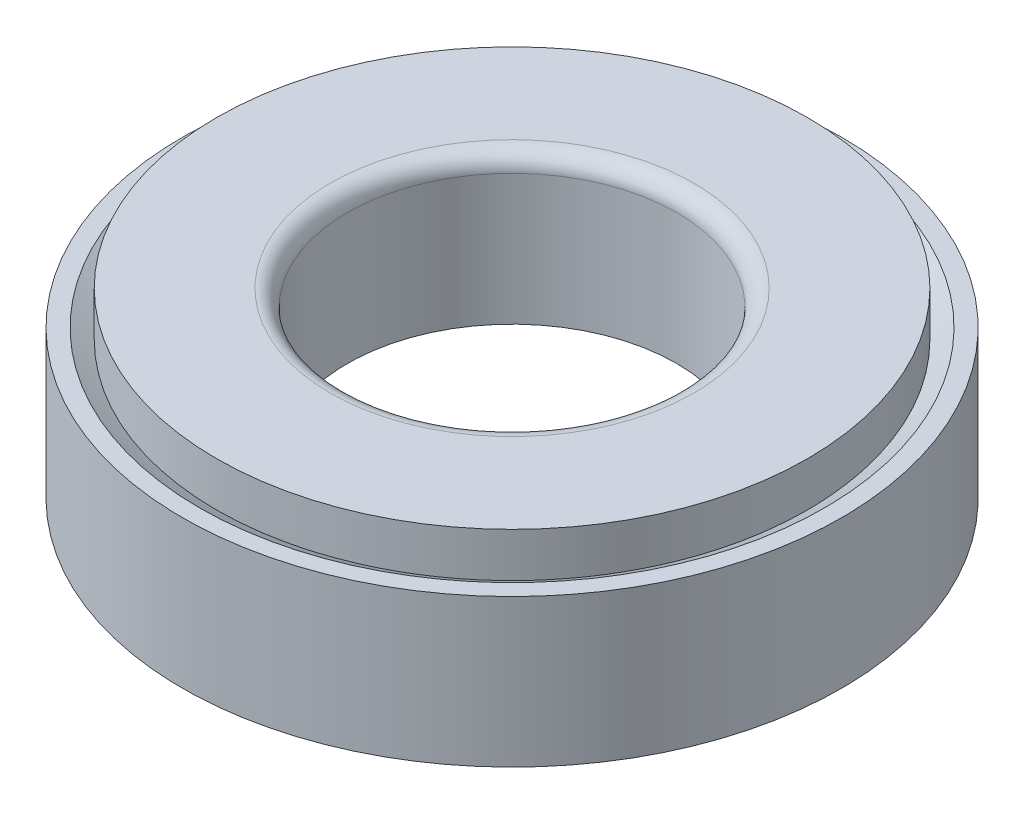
ISO-10303-21;
HEADER;
FILE_DESCRIPTION(('STEP AP214'),'2;1');
FILE_NAME('part.step','',(''),(''),'','','');
FILE_SCHEMA(('AUTOMOTIVE_DESIGN { 1 0 10303 214 1 1 1 1 }'));
ENDSEC;
DATA;
#1=APPLICATION_CONTEXT('core data for automotive mechanical design processes');
#2=APPLICATION_PROTOCOL_DEFINITION('international standard','automotive_design',2000,#1);
#3=PRODUCT_CONTEXT('',#1,'mechanical');
#4=PRODUCT('Part','Part','',(#3));
#5=PRODUCT_RELATED_PRODUCT_CATEGORY('part','',(#4));
#6=PRODUCT_DEFINITION_FORMATION('','',#4);
#7=PRODUCT_DEFINITION_CONTEXT('part definition',#1,'design');
#8=PRODUCT_DEFINITION('design','',#6,#7);
#9=PRODUCT_DEFINITION_SHAPE('','',#8);
#10=(LENGTH_UNIT() NAMED_UNIT(*) SI_UNIT(.MILLI.,.METRE.));
#11=(NAMED_UNIT(*) PLANE_ANGLE_UNIT() SI_UNIT($,.RADIAN.));
#12=(NAMED_UNIT(*) SI_UNIT($,.STERADIAN.) SOLID_ANGLE_UNIT());
#13=UNCERTAINTY_MEASURE_WITH_UNIT(LENGTH_MEASURE(1.E-05),#10,'distance_accuracy_value','');
#14=(GEOMETRIC_REPRESENTATION_CONTEXT(3) GLOBAL_UNCERTAINTY_ASSIGNED_CONTEXT((#13)) GLOBAL_UNIT_ASSIGNED_CONTEXT((#10,
#11,#12)) REPRESENTATION_CONTEXT('',''));
#15=CARTESIAN_POINT('',(0.,0.,0.));
#16=DIRECTION('',(0.,0.,1.));
#17=DIRECTION('',(1.,0.,0.));
#18=AXIS2_PLACEMENT_3D('',#15,#16,#17);
#19=CARTESIAN_POINT('',(0.,16.,0.));
#20=DIRECTION('',(0.,-1.,0.));
#21=DIRECTION('',(0.,0.,-1.));
#22=AXIS2_PLACEMENT_3D('',#19,#20,#21);
#23=CYLINDRICAL_SURFACE('',#22,26.);
#24=CARTESIAN_POINT('',(0.,12.079687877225,0.));
#25=DIRECTION('',(0.,1.,0.));
#26=DIRECTION('',(0.,0.,1.));
#27=AXIS2_PLACEMENT_3D('',#24,#25,#26);
#28=CIRCLE('',#27,26.);
#29=CARTESIAN_POINT('',(0.,12.079687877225,26.));
#30=VERTEX_POINT('',#29);
#31=EDGE_CURVE('P0_E29',#30,#30,#28,.T.);
#32=ORIENTED_EDGE('',*,*,#31,.T.);
#33=EDGE_LOOP('',(#32));
#34=FACE_BOUND('',#33,.T.);
#35=CARTESIAN_POINT('',(0.,16.,0.));
#36=DIRECTION('',(0.,1.,0.));
#37=DIRECTION('',(0.,0.,1.));
#38=AXIS2_PLACEMENT_3D('',#35,#36,#37);
#39=CIRCLE('',#38,26.);
#40=CARTESIAN_POINT('',(0.,16.,26.));
#41=VERTEX_POINT('',#40);
#42=EDGE_CURVE('P0_E25',#41,#41,#39,.T.);
#43=ORIENTED_EDGE('',*,*,#42,.F.);
#44=EDGE_LOOP('',(#43));
#45=FACE_BOUND('',#44,.T.);
#46=ADVANCED_FACE('P0_F14',(#34,#45),#23,.T.);
#47=CARTESIAN_POINT('',(0.,16.,0.));
#48=DIRECTION('',(0.,1.,0.));
#49=DIRECTION('',(0.,0.,1.));
#50=AXIS2_PLACEMENT_3D('',#47,#48,#49);
#51=PLANE('',#50);
#52=CARTESIAN_POINT('',(0.,16.,0.));
#53=DIRECTION('',(0.,1.,0.));
#54=DIRECTION('',(0.,0.,1.));
#55=AXIS2_PLACEMENT_3D('',#52,#53,#54);
#56=CIRCLE('',#55,16.);
#57=CARTESIAN_POINT('',(0.,16.,16.));
#58=VERTEX_POINT('',#57);
#59=EDGE_CURVE('P0_E21',#58,#58,#56,.F.);
#60=ORIENTED_EDGE('',*,*,#59,.T.);
#61=EDGE_LOOP('',(#60));
#62=FACE_BOUND('',#61,.T.);
#63=ORIENTED_EDGE('',*,*,#42,.T.);
#64=EDGE_LOOP('',(#63));
#65=FACE_BOUND('',#64,.T.);
#66=ADVANCED_FACE('P0_F92',(#62,#65),#51,.T.);
#67=CARTESIAN_POINT('',(0.,56.1391826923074,0.));
#68=DIRECTION('',(-1.,0.,0.));
#69=DIRECTION('',(0.,-1.,0.));
#70=AXIS2_PLACEMENT_3D('',#67,#68,#69);
#71=SPHERICAL_SURFACE('',#70,51.1589589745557);
#72=CARTESIAN_POINT('',(0.,56.1391826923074,0.));
#73=DIRECTION('',(0.,1.,0.));
#74=DIRECTION('',(0.,0.,1.));
#75=AXIS2_PLACEMENT_3D('',#72,#73,#74);
#76=SPHERICAL_SURFACE('',#75,51.1589589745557);
#77=CARTESIAN_POINT('',(0.,7.80000000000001,0.));
#78=DIRECTION('',(0.,1.,0.));
#79=DIRECTION('',(0.,0.,1.));
#80=AXIS2_PLACEMENT_3D('',#77,#78,#79);
#81=CIRCLE('',#80,16.75);
#82=CARTESIAN_POINT('',(0.,7.80000000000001,16.75));
#83=VERTEX_POINT('',#82);
#84=EDGE_CURVE('P0_E49',#83,#83,#81,.T.);
#85=ORIENTED_EDGE('',*,*,#84,.T.);
#86=EDGE_LOOP('',(#85));
#87=FACE_BOUND('',#86,.T.);
#88=ORIENTED_EDGE('',*,*,#31,.F.);
#89=EDGE_LOOP('',(#88));
#90=FACE_BOUND('',#89,.T.);
#91=ADVANCED_FACE('P0_F53',(#87,#90),#76,.T.);
#92=CARTESIAN_POINT('',(0.,3.,0.));
#93=DIRECTION('',(0.,1.,0.));
#94=DIRECTION('',(0.,0.,1.));
#95=AXIS2_PLACEMENT_3D('',#92,#93,#94);
#96=CYLINDRICAL_SURFACE('',#95,16.75);
#97=CARTESIAN_POINT('',(0.,5.4,0.));
#98=DIRECTION('',(0.,1.,0.));
#99=DIRECTION('',(0.,0.,1.));
#100=AXIS2_PLACEMENT_3D('',#97,#98,#99);
#101=CIRCLE('',#100,16.75);
#102=CARTESIAN_POINT('',(0.,5.4,16.75));
#103=VERTEX_POINT('',#102);
#104=EDGE_CURVE('P0_E40',#103,#103,#101,.T.);
#105=CARTESIAN_POINT('',(0.,3.,0.));
#106=DIRECTION('',(0.,1.,0.));
#107=DIRECTION('',(0.,0.,1.));
#108=AXIS2_PLACEMENT_3D('',#105,#106,#107);
#109=CIRCLE('',#108,16.75);
#110=CARTESIAN_POINT('',(0.,3.,16.75));
#111=VERTEX_POINT('',#110);
#112=EDGE_CURVE('P0_E33',#111,#111,#109,.T.);
#113=CARTESIAN_POINT('',(0.,5.4,16.75));
#114=CARTESIAN_POINT('',(0.,5.375,16.75));
#115=CARTESIAN_POINT('',(0.,5.34999999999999,16.75));
#116=CARTESIAN_POINT('',(0.,5.29999999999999,16.75));
#117=CARTESIAN_POINT('',(0.,5.275,16.75));
#118=CARTESIAN_POINT('',(0.,5.225,16.75));
#119=CARTESIAN_POINT('',(0.,5.2,16.75));
#120=CARTESIAN_POINT('',(0.,5.15,16.75));
#121=CARTESIAN_POINT('',(0.,5.12499999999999,16.75));
#122=CARTESIAN_POINT('',(0.,5.075,16.75));
#123=CARTESIAN_POINT('',(0.,5.05,16.75));
#124=CARTESIAN_POINT('',(0.,5.,16.75));
#125=CARTESIAN_POINT('',(0.,4.975,16.75));
#126=CARTESIAN_POINT('',(0.,4.925,16.75));
#127=CARTESIAN_POINT('',(0.,4.9,16.75));
#128=CARTESIAN_POINT('',(0.,4.85,16.75));
#129=CARTESIAN_POINT('',(0.,4.825,16.75));
#130=CARTESIAN_POINT('',(0.,4.775,16.75));
#131=CARTESIAN_POINT('',(0.,4.75,16.75));
#132=CARTESIAN_POINT('',(0.,4.7,16.75));
#133=CARTESIAN_POINT('',(0.,4.675,16.75));
#134=CARTESIAN_POINT('',(0.,4.625,16.75));
#135=CARTESIAN_POINT('',(0.,4.6,16.75));
#136=CARTESIAN_POINT('',(0.,4.55,16.75));
#137=CARTESIAN_POINT('',(0.,4.525,16.75));
#138=CARTESIAN_POINT('',(0.,4.475,16.75));
#139=CARTESIAN_POINT('',(0.,4.45,16.75));
#140=CARTESIAN_POINT('',(0.,4.4,16.75));
#141=CARTESIAN_POINT('',(0.,4.375,16.75));
#142=CARTESIAN_POINT('',(0.,4.325,16.75));
#143=CARTESIAN_POINT('',(0.,4.3,16.75));
#144=CARTESIAN_POINT('',(0.,4.25,16.75));
#145=CARTESIAN_POINT('',(0.,4.225,16.75));
#146=CARTESIAN_POINT('',(0.,4.175,16.75));
#147=CARTESIAN_POINT('',(0.,4.15,16.75));
#148=CARTESIAN_POINT('',(0.,4.1,16.75));
#149=CARTESIAN_POINT('',(0.,4.075,16.75));
#150=CARTESIAN_POINT('',(0.,4.025,16.75));
#151=CARTESIAN_POINT('',(0.,4.,16.75));
#152=CARTESIAN_POINT('',(0.,3.95,16.75));
#153=CARTESIAN_POINT('',(0.,3.925,16.75));
#154=CARTESIAN_POINT('',(0.,3.875,16.75));
#155=CARTESIAN_POINT('',(0.,3.85,16.75));
#156=CARTESIAN_POINT('',(0.,3.8,16.75));
#157=CARTESIAN_POINT('',(0.,3.775,16.75));
#158=CARTESIAN_POINT('',(0.,3.725,16.75));
#159=CARTESIAN_POINT('',(0.,3.7,16.75));
#160=CARTESIAN_POINT('',(0.,3.65,16.75));
#161=CARTESIAN_POINT('',(0.,3.625,16.75));
#162=CARTESIAN_POINT('',(0.,3.575,16.75));
#163=CARTESIAN_POINT('',(0.,3.55,16.75));
#164=CARTESIAN_POINT('',(0.,3.5,16.75));
#165=CARTESIAN_POINT('',(0.,3.475,16.75));
#166=CARTESIAN_POINT('',(0.,3.425,16.75));
#167=CARTESIAN_POINT('',(0.,3.4,16.75));
#168=CARTESIAN_POINT('',(0.,3.35,16.75));
#169=CARTESIAN_POINT('',(0.,3.325,16.75));
#170=CARTESIAN_POINT('',(0.,3.275,16.75));
#171=CARTESIAN_POINT('',(0.,3.25,16.75));
#172=CARTESIAN_POINT('',(0.,3.2,16.75));
#173=CARTESIAN_POINT('',(0.,3.175,16.75));
#174=CARTESIAN_POINT('',(0.,3.125,16.75));
#175=CARTESIAN_POINT('',(0.,3.1,16.75));
#176=CARTESIAN_POINT('',(0.,3.05,16.75));
#177=CARTESIAN_POINT('',(0.,3.025,16.75));
#178=CARTESIAN_POINT('',(0.,3.,16.75));
#179=B_SPLINE_CURVE_WITH_KNOTS('',3,(#113,#114,#115,#116,#117,#118,#119,#120,#121,#122,#123,
#124,#125,#126,#127,#128,#129,#130,#131,#132,#133,#134,#135,#136,#137,#138,#139,#140,#141,#142,
#143,#144,#145,#146,#147,#148,#149,#150,#151,#152,#153,#154,#155,#156,#157,#158,#159,#160,#161,
#162,#163,#164,#165,#166,#167,#168,#169,#170,#171,#172,#173,#174,#175,#176,#177,#178),
.UNSPECIFIED.,.F.,.F.,(4,2,2,2,2,2,2,2,2,2,2,2,2,2,2,2,2,2,2,2,2,2,2,2,2,2,2,2,2,2,2,2,4),(0.,
0.0750000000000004,0.15,0.225,0.3,0.374999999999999,0.449999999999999,0.524999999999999,
0.599999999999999,0.674999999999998,0.749999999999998,0.824999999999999,0.899999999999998,
0.974999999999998,1.05,1.125,1.2,1.275,1.35,1.425,1.5,1.575,1.65,1.725,1.8,1.875,1.95,2.025,2.1,
2.17499999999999,2.24999999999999,2.32499999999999,2.39999999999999),.UNSPECIFIED.);
#180=EDGE_CURVE('P0_BSEAM75',#103,#111,#179,.T.);
#181=ORIENTED_EDGE('',*,*,#104,.F.);
#182=ORIENTED_EDGE('',*,*,#112,.T.);
#183=ORIENTED_EDGE('',*,*,#180,.T.);
#184=ORIENTED_EDGE('',*,*,#180,.F.);
#185=EDGE_LOOP('',(#181,#183,#182,#184));
#186=FACE_BOUND('',#185,.T.);
#187=ADVANCED_FACE('P0_F75',(#186),#96,.T.);
#188=CARTESIAN_POINT('',(0.,3.,0.));
#189=DIRECTION('',(0.,1.,0.));
#190=DIRECTION('',(0.,0.,1.));
#191=AXIS2_PLACEMENT_3D('',#188,#189,#190);
#192=PLANE('',#191);
#193=CARTESIAN_POINT('',(0.,3.,0.));
#194=DIRECTION('',(0.,-1.,0.));
#195=DIRECTION('',(0.,0.,-1.));
#196=AXIS2_PLACEMENT_3D('',#193,#194,#195);
#197=CIRCLE('',#196,14.5);
#198=CARTESIAN_POINT('',(0.,3.,-14.5));
#199=VERTEX_POINT('',#198);
#200=EDGE_CURVE('P0_E37',#199,#199,#197,.T.);
#201=ORIENTED_EDGE('',*,*,#200,.F.);
#202=EDGE_LOOP('',(#201));
#203=FACE_BOUND('',#202,.T.);
#204=ORIENTED_EDGE('',*,*,#112,.F.);
#205=EDGE_LOOP('',(#204));
#206=FACE_BOUND('',#205,.T.);
#207=ADVANCED_FACE('P0_F78',(#203,#206),#192,.F.);
#208=CARTESIAN_POINT('',(0.,16.,0.));
#209=DIRECTION('',(0.,-1.,0.));
#210=DIRECTION('',(0.,0.,-1.));
#211=AXIS2_PLACEMENT_3D('',#208,#209,#210);
#212=CYLINDRICAL_SURFACE('',#211,14.5);
#213=CARTESIAN_POINT('',(0.,14.5,0.));
#214=DIRECTION('',(0.,1.,0.));
#215=DIRECTION('',(0.,0.,1.));
#216=AXIS2_PLACEMENT_3D('',#213,#214,#215);
#217=CIRCLE('',#216,14.5);
#218=CARTESIAN_POINT('',(0.,14.5,-14.5));
#219=VERTEX_POINT('',#218);
#220=EDGE_CURVE('P0_E10',#219,#219,#217,.T.);
#221=CARTESIAN_POINT('',(0.,14.5,-14.5));
#222=CARTESIAN_POINT('',(0.,14.3802083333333,-14.5));
#223=CARTESIAN_POINT('',(0.,14.2604166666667,-14.5));
#224=CARTESIAN_POINT('',(0.,14.0208333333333,-14.5));
#225=CARTESIAN_POINT('',(0.,13.9010416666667,-14.5));
#226=CARTESIAN_POINT('',(0.,13.6614583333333,-14.5));
#227=CARTESIAN_POINT('',(0.,13.5416666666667,-14.5));
#228=CARTESIAN_POINT('',(0.,13.3020833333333,-14.5));
#229=CARTESIAN_POINT('',(0.,13.1822916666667,-14.5));
#230=CARTESIAN_POINT('',(0.,12.9427083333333,-14.5));
#231=CARTESIAN_POINT('',(0.,12.8229166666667,-14.5));
#232=CARTESIAN_POINT('',(0.,12.5833333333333,-14.5));
#233=CARTESIAN_POINT('',(0.,12.4635416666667,-14.5));
#234=CARTESIAN_POINT('',(0.,12.2239583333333,-14.5));
#235=CARTESIAN_POINT('',(0.,12.1041666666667,-14.5));
#236=CARTESIAN_POINT('',(0.,11.8645833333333,-14.5));
#237=CARTESIAN_POINT('',(0.,11.7447916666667,-14.5));
#238=CARTESIAN_POINT('',(0.,11.5052083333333,-14.5));
#239=CARTESIAN_POINT('',(0.,11.3854166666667,-14.5));
#240=CARTESIAN_POINT('',(0.,11.1458333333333,-14.5));
#241=CARTESIAN_POINT('',(0.,11.0260416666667,-14.5));
#242=CARTESIAN_POINT('',(0.,10.7864583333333,-14.5));
#243=CARTESIAN_POINT('',(0.,10.6666666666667,-14.5));
#244=CARTESIAN_POINT('',(0.,10.4270833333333,-14.5));
#245=CARTESIAN_POINT('',(0.,10.3072916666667,-14.5));
#246=CARTESIAN_POINT('',(0.,10.0677083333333,-14.5));
#247=CARTESIAN_POINT('',(0.,9.94791666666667,-14.5));
#248=CARTESIAN_POINT('',(0.,9.70833333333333,-14.5));
#249=CARTESIAN_POINT('',(0.,9.58854166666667,-14.5));
#250=CARTESIAN_POINT('',(0.,9.34895833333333,-14.5));
#251=CARTESIAN_POINT('',(0.,9.22916666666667,-14.5));
#252=CARTESIAN_POINT('',(0.,8.98958333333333,-14.5));
#253=CARTESIAN_POINT('',(0.,8.86979166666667,-14.5));
#254=CARTESIAN_POINT('',(0.,8.63020833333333,-14.5));
#255=CARTESIAN_POINT('',(0.,8.51041666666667,-14.5));
#256=CARTESIAN_POINT('',(0.,8.27083333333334,-14.5));
#257=CARTESIAN_POINT('',(0.,8.15104166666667,-14.5));
#258=CARTESIAN_POINT('',(0.,7.91145833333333,-14.5));
#259=CARTESIAN_POINT('',(0.,7.79166666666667,-14.5));
#260=CARTESIAN_POINT('',(0.,7.55208333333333,-14.5));
#261=CARTESIAN_POINT('',(0.,7.43229166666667,-14.5));
#262=CARTESIAN_POINT('',(0.,7.19270833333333,-14.5));
#263=CARTESIAN_POINT('',(0.,7.07291666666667,-14.5));
#264=CARTESIAN_POINT('',(0.,6.83333333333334,-14.5));
#265=CARTESIAN_POINT('',(0.,6.71354166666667,-14.5));
#266=CARTESIAN_POINT('',(0.,6.47395833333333,-14.5));
#267=CARTESIAN_POINT('',(0.,6.35416666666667,-14.5));
#268=CARTESIAN_POINT('',(0.,6.11458333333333,-14.5));
#269=CARTESIAN_POINT('',(0.,5.99479166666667,-14.5));
#270=CARTESIAN_POINT('',(0.,5.75520833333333,-14.5));
#271=CARTESIAN_POINT('',(0.,5.63541666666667,-14.5));
#272=CARTESIAN_POINT('',(0.,5.39583333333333,-14.5));
#273=CARTESIAN_POINT('',(0.,5.27604166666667,-14.5));
#274=CARTESIAN_POINT('',(0.,5.03645833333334,-14.5));
#275=CARTESIAN_POINT('',(0.,4.91666666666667,-14.5));
#276=CARTESIAN_POINT('',(0.,4.67708333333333,-14.5));
#277=CARTESIAN_POINT('',(0.,4.55729166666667,-14.5));
#278=CARTESIAN_POINT('',(0.,4.31770833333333,-14.5));
#279=CARTESIAN_POINT('',(0.,4.19791666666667,-14.5));
#280=CARTESIAN_POINT('',(0.,3.95833333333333,-14.5));
#281=CARTESIAN_POINT('',(0.,3.83854166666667,-14.5));
#282=CARTESIAN_POINT('',(0.,3.59895833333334,-14.5));
#283=CARTESIAN_POINT('',(0.,3.47916666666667,-14.5));
#284=CARTESIAN_POINT('',(0.,3.23958333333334,-14.5));
#285=CARTESIAN_POINT('',(0.,3.11979166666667,-14.5));
#286=CARTESIAN_POINT('',(0.,3.,-14.5));
#287=B_SPLINE_CURVE_WITH_KNOTS('',3,(#221,#222,#223,#224,#225,#226,#227,#228,#229,#230,#231,
#232,#233,#234,#235,#236,#237,#238,#239,#240,#241,#242,#243,#244,#245,#246,#247,#248,#249,#250,
#251,#252,#253,#254,#255,#256,#257,#258,#259,#260,#261,#262,#263,#264,#265,#266,#267,#268,#269,
#270,#271,#272,#273,#274,#275,#276,#277,#278,#279,#280,#281,#282,#283,#284,#285,#286),
.UNSPECIFIED.,.F.,.F.,(4,2,2,2,2,2,2,2,2,2,2,2,2,2,2,2,2,2,2,2,2,2,2,2,2,2,2,2,2,2,2,2,4),(0.,
0.359375,0.718750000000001,1.078125,1.4375,1.796875,2.15625,2.515625,2.875,3.234375,3.59375,
3.953125,4.3125,4.671875,5.03125,5.390625,5.75,6.109375,6.46875,6.828125,7.1875,7.546875,
7.90625,8.265625,8.625,8.984375,9.34375,9.703125,10.0625,10.421875,10.78125,11.140625,11.5),.UNSPECIFIED.);
#288=EDGE_CURVE('P0_BSEAM71',#219,#199,#287,.T.);
#289=ORIENTED_EDGE('',*,*,#220,.T.);
#290=ORIENTED_EDGE('',*,*,#200,.T.);
#291=ORIENTED_EDGE('',*,*,#288,.T.);
#292=ORIENTED_EDGE('',*,*,#288,.F.);
#293=EDGE_LOOP('',(#289,#291,#290,#292));
#294=FACE_BOUND('',#293,.T.);
#295=ADVANCED_FACE('P0_F71',(#294),#212,.F.);
#296=CARTESIAN_POINT('',(-16.75,5.4,0.));
#297=DIRECTION('',(0.,-1.,0.));
#298=DIRECTION('',(0.,0.,-1.));
#299=AXIS2_PLACEMENT_3D('',#296,#297,#298);
#300=PLANE('',#299);
#301=CARTESIAN_POINT('',(0.,5.4,0.));
#302=DIRECTION('',(0.,1.,0.));
#303=DIRECTION('',(0.,0.,1.));
#304=AXIS2_PLACEMENT_3D('',#301,#302,#303);
#305=CIRCLE('',#304,15.625);
#306=CARTESIAN_POINT('',(0.,5.4,15.625));
#307=VERTEX_POINT('',#306);
#308=EDGE_CURVE('P0_E43',#307,#307,#305,.T.);
#309=ORIENTED_EDGE('',*,*,#308,.F.);
#310=EDGE_LOOP('',(#309));
#311=FACE_BOUND('',#310,.T.);
#312=ORIENTED_EDGE('',*,*,#104,.T.);
#313=EDGE_LOOP('',(#312));
#314=FACE_BOUND('',#313,.T.);
#315=ADVANCED_FACE('P0_F65',(#311,#314),#300,.F.);
#316=CARTESIAN_POINT('',(0.,16.,0.));
#317=DIRECTION('',(0.,1.,0.));
#318=DIRECTION('',(0.,0.,1.));
#319=AXIS2_PLACEMENT_3D('',#316,#317,#318);
#320=CYLINDRICAL_SURFACE('',#319,15.625);
#321=CARTESIAN_POINT('',(0.,7.80000000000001,0.));
#322=DIRECTION('',(0.,1.,0.));
#323=DIRECTION('',(0.,0.,1.));
#324=AXIS2_PLACEMENT_3D('',#321,#322,#323);
#325=CIRCLE('',#324,15.625);
#326=CARTESIAN_POINT('',(0.,7.80000000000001,15.625));
#327=VERTEX_POINT('',#326);
#328=EDGE_CURVE('P0_E46',#327,#327,#325,.T.);
#329=ORIENTED_EDGE('',*,*,#328,.F.);
#330=EDGE_LOOP('',(#329));
#331=FACE_BOUND('',#330,.T.);
#332=ORIENTED_EDGE('',*,*,#308,.T.);
#333=EDGE_LOOP('',(#332));
#334=FACE_BOUND('',#333,.T.);
#335=ADVANCED_FACE('P0_F59',(#331,#334),#320,.T.);
#336=CARTESIAN_POINT('',(-16.75,7.80000000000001,0.));
#337=DIRECTION('',(0.,1.,0.));
#338=DIRECTION('',(0.,0.,1.));
#339=AXIS2_PLACEMENT_3D('',#336,#337,#338);
#340=PLANE('',#339);
#341=ORIENTED_EDGE('',*,*,#84,.F.);
#342=EDGE_LOOP('',(#341));
#343=FACE_BOUND('',#342,.T.);
#344=ORIENTED_EDGE('',*,*,#328,.T.);
#345=EDGE_LOOP('',(#344));
#346=FACE_BOUND('',#345,.T.);
#347=ADVANCED_FACE('P0_F56',(#343,#346),#340,.F.);
#348=CARTESIAN_POINT('',(0.,14.5,0.));
#349=DIRECTION('',(0.,1.,0.));
#350=DIRECTION('',(0.,0.,1.));
#351=AXIS2_PLACEMENT_3D('',#348,#349,#350);
#352=TOROIDAL_SURFACE('',#351,16.,1.5);
#353=ORIENTED_EDGE('',*,*,#220,.F.);
#354=EDGE_LOOP('',(#353));
#355=FACE_BOUND('',#354,.T.);
#356=ORIENTED_EDGE('',*,*,#59,.F.);
#357=EDGE_LOOP('',(#356));
#358=FACE_BOUND('',#357,.T.);
#359=ADVANCED_FACE('P0_F16',(#355,#358),#352,.T.);
#360=CLOSED_SHELL('',(#46,#66,#91,#187,#207,#295,#315,#335,#347,#359));
#361=MANIFOLD_SOLID_BREP('P0_B1',#360);
#362=CARTESIAN_POINT('',(0.,13.,0.));
#363=DIRECTION('',(0.,-1.,0.));
#364=DIRECTION('',(0.,0.,-1.));
#365=AXIS2_PLACEMENT_3D('',#362,#363,#364);
#366=CYLINDRICAL_SURFACE('',#365,29.);
#367=CARTESIAN_POINT('',(0.,13.,0.));
#368=DIRECTION('',(0.,1.,0.));
#369=DIRECTION('',(0.,0.,1.));
#370=AXIS2_PLACEMENT_3D('',#367,#368,#369);
#371=CIRCLE('',#370,29.);
#372=CARTESIAN_POINT('',(0.,13.,-29.));
#373=VERTEX_POINT('',#372);
#374=EDGE_CURVE('P1_E9',#373,#373,#371,.T.);
#375=CARTESIAN_POINT('',(0.,0.,0.));
#376=DIRECTION('',(0.,1.,0.));
#377=DIRECTION('',(0.,0.,1.));
#378=AXIS2_PLACEMENT_3D('',#375,#376,#377);
#379=CIRCLE('',#378,29.);
#380=CARTESIAN_POINT('',(0.,0.,-29.));
#381=VERTEX_POINT('',#380);
#382=EDGE_CURVE('P1_E20',#381,#381,#379,.T.);
#383=CARTESIAN_POINT('',(0.,13.,-29.));
#384=CARTESIAN_POINT('',(0.,12.8645833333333,-29.));
#385=CARTESIAN_POINT('',(0.,12.7291666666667,-29.));
#386=CARTESIAN_POINT('',(0.,12.4583333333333,-29.));
#387=CARTESIAN_POINT('',(0.,12.3229166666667,-29.));
#388=CARTESIAN_POINT('',(0.,12.0520833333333,-29.));
#389=CARTESIAN_POINT('',(0.,11.9166666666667,-29.));
#390=CARTESIAN_POINT('',(0.,11.6458333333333,-29.));
#391=CARTESIAN_POINT('',(0.,11.5104166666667,-29.));
#392=CARTESIAN_POINT('',(0.,11.2395833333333,-29.));
#393=CARTESIAN_POINT('',(0.,11.1041666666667,-29.));
#394=CARTESIAN_POINT('',(0.,10.8333333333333,-29.));
#395=CARTESIAN_POINT('',(0.,10.6979166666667,-29.));
#396=CARTESIAN_POINT('',(0.,10.4270833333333,-29.));
#397=CARTESIAN_POINT('',(0.,10.2916666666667,-29.));
#398=CARTESIAN_POINT('',(0.,10.0208333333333,-29.));
#399=CARTESIAN_POINT('',(0.,9.88541666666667,-29.));
#400=CARTESIAN_POINT('',(0.,9.61458333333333,-29.));
#401=CARTESIAN_POINT('',(0.,9.47916666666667,-29.));
#402=CARTESIAN_POINT('',(0.,9.20833333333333,-29.));
#403=CARTESIAN_POINT('',(0.,9.07291666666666,-29.));
#404=CARTESIAN_POINT('',(0.,8.80208333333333,-29.));
#405=CARTESIAN_POINT('',(0.,8.66666666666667,-29.));
#406=CARTESIAN_POINT('',(0.,8.39583333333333,-29.));
#407=CARTESIAN_POINT('',(0.,8.26041666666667,-29.));
#408=CARTESIAN_POINT('',(0.,7.98958333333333,-29.));
#409=CARTESIAN_POINT('',(0.,7.85416666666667,-29.));
#410=CARTESIAN_POINT('',(0.,7.58333333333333,-29.));
#411=CARTESIAN_POINT('',(0.,7.44791666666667,-29.));
#412=CARTESIAN_POINT('',(0.,7.17708333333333,-29.));
#413=CARTESIAN_POINT('',(0.,7.04166666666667,-29.));
#414=CARTESIAN_POINT('',(0.,6.77083333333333,-29.));
#415=CARTESIAN_POINT('',(0.,6.63541666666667,-29.));
#416=CARTESIAN_POINT('',(0.,6.36458333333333,-29.));
#417=CARTESIAN_POINT('',(0.,6.22916666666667,-29.));
#418=CARTESIAN_POINT('',(0.,5.95833333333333,-29.));
#419=CARTESIAN_POINT('',(0.,5.82291666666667,-29.));
#420=CARTESIAN_POINT('',(0.,5.55208333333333,-29.));
#421=CARTESIAN_POINT('',(0.,5.41666666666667,-29.));
#422=CARTESIAN_POINT('',(0.,5.14583333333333,-29.));
#423=CARTESIAN_POINT('',(0.,5.01041666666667,-29.));
#424=CARTESIAN_POINT('',(0.,4.73958333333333,-29.));
#425=CARTESIAN_POINT('',(0.,4.60416666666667,-29.));
#426=CARTESIAN_POINT('',(0.,4.33333333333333,-29.));
#427=CARTESIAN_POINT('',(0.,4.19791666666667,-29.));
#428=CARTESIAN_POINT('',(0.,3.92708333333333,-29.));
#429=CARTESIAN_POINT('',(0.,3.79166666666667,-29.));
#430=CARTESIAN_POINT('',(0.,3.52083333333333,-29.));
#431=CARTESIAN_POINT('',(0.,3.38541666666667,-29.));
#432=CARTESIAN_POINT('',(0.,3.11458333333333,-29.));
#433=CARTESIAN_POINT('',(0.,2.97916666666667,-29.));
#434=CARTESIAN_POINT('',(0.,2.70833333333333,-29.));
#435=CARTESIAN_POINT('',(0.,2.57291666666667,-29.));
#436=CARTESIAN_POINT('',(0.,2.30208333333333,-29.));
#437=CARTESIAN_POINT('',(0.,2.16666666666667,-29.));
#438=CARTESIAN_POINT('',(0.,1.89583333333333,-29.));
#439=CARTESIAN_POINT('',(0.,1.76041666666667,-29.));
#440=CARTESIAN_POINT('',(0.,1.48958333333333,-29.));
#441=CARTESIAN_POINT('',(0.,1.35416666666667,-29.));
#442=CARTESIAN_POINT('',(0.,1.08333333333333,-29.));
#443=CARTESIAN_POINT('',(0.,0.947916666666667,-29.));
#444=CARTESIAN_POINT('',(0.,0.677083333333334,-29.));
#445=CARTESIAN_POINT('',(0.,0.541666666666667,-29.));
#446=CARTESIAN_POINT('',(0.,0.270833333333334,-29.));
#447=CARTESIAN_POINT('',(0.,0.135416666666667,-29.));
#448=CARTESIAN_POINT('',(0.,0.,-29.));
#449=B_SPLINE_CURVE_WITH_KNOTS('',3,(#383,#384,#385,#386,#387,#388,#389,#390,#391,#392,#393,
#394,#395,#396,#397,#398,#399,#400,#401,#402,#403,#404,#405,#406,#407,#408,#409,#410,#411,#412,
#413,#414,#415,#416,#417,#418,#419,#420,#421,#422,#423,#424,#425,#426,#427,#428,#429,#430,#431,
#432,#433,#434,#435,#436,#437,#438,#439,#440,#441,#442,#443,#444,#445,#446,#447,#448),
.UNSPECIFIED.,.F.,.F.,(4,2,2,2,2,2,2,2,2,2,2,2,2,2,2,2,2,2,2,2,2,2,2,2,2,2,2,2,2,2,2,2,4),(0.,
0.40625,0.812500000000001,1.21875,1.625,2.03125,2.4375,2.84375,3.25,3.65625,4.0625,4.46875,
4.875,5.28125,5.6875,6.09375,6.5,6.90625,7.3125,7.71875,8.125,8.53125,8.9375,9.34375,9.75,
10.15625,10.5625,10.96875,11.375,11.78125,12.1875,12.59375,13.),.UNSPECIFIED.);
#450=EDGE_CURVE('P1_BSEAM13',#373,#381,#449,.T.);
#451=ORIENTED_EDGE('',*,*,#374,.F.);
#452=ORIENTED_EDGE('',*,*,#382,.T.);
#453=ORIENTED_EDGE('',*,*,#450,.T.);
#454=ORIENTED_EDGE('',*,*,#450,.F.);
#455=EDGE_LOOP('',(#451,#453,#452,#454));
#456=FACE_BOUND('',#455,.T.);
#457=ADVANCED_FACE('P1_F13',(#456),#366,.T.);
#458=CARTESIAN_POINT('',(0.,13.,0.));
#459=DIRECTION('',(0.,1.,0.));
#460=DIRECTION('',(0.,0.,1.));
#461=AXIS2_PLACEMENT_3D('',#458,#459,#460);
#462=PLANE('',#461);
#463=CARTESIAN_POINT('',(0.,13.,0.));
#464=DIRECTION('',(0.,1.,0.));
#465=DIRECTION('',(0.,0.,1.));
#466=AXIS2_PLACEMENT_3D('',#463,#464,#465);
#467=CIRCLE('',#466,27.5);
#468=CARTESIAN_POINT('',(0.,13.,27.5));
#469=VERTEX_POINT('',#468);
#470=EDGE_CURVE('P1_E35',#469,#469,#467,.T.);
#471=ORIENTED_EDGE('',*,*,#470,.F.);
#472=EDGE_LOOP('',(#471));
#473=FACE_BOUND('',#472,.T.);
#474=ORIENTED_EDGE('',*,*,#374,.T.);
#475=EDGE_LOOP('',(#474));
#476=FACE_BOUND('',#475,.T.);
#477=ADVANCED_FACE('P1_F55',(#473,#476),#462,.T.);
#478=CARTESIAN_POINT('',(0.,0.,0.));
#479=DIRECTION('',(0.,1.,0.));
#480=DIRECTION('',(0.,0.,1.));
#481=AXIS2_PLACEMENT_3D('',#478,#479,#480);
#482=PLANE('',#481);
#483=CARTESIAN_POINT('',(0.,0.,0.));
#484=DIRECTION('',(0.,-1.,0.));
#485=DIRECTION('',(0.,0.,-1.));
#486=AXIS2_PLACEMENT_3D('',#483,#484,#485);
#487=CIRCLE('',#486,19.);
#488=CARTESIAN_POINT('',(0.,0.,-19.));
#489=VERTEX_POINT('',#488);
#490=EDGE_CURVE('P1_E27',#489,#489,#487,.T.);
#491=ORIENTED_EDGE('',*,*,#490,.F.);
#492=EDGE_LOOP('',(#491));
#493=FACE_BOUND('',#492,.T.);
#494=ORIENTED_EDGE('',*,*,#382,.F.);
#495=EDGE_LOOP('',(#494));
#496=FACE_BOUND('',#495,.T.);
#497=ADVANCED_FACE('P1_F60',(#493,#496),#482,.F.);
#498=CARTESIAN_POINT('',(0.,6.5,0.));
#499=DIRECTION('',(0.,-1.,0.));
#500=DIRECTION('',(0.,0.,-1.));
#501=AXIS2_PLACEMENT_3D('',#498,#499,#500);
#502=CYLINDRICAL_SURFACE('',#501,19.);
#503=CARTESIAN_POINT('',(0.,6.5,0.));
#504=DIRECTION('',(0.,-1.,0.));
#505=DIRECTION('',(0.,0.,-1.));
#506=AXIS2_PLACEMENT_3D('',#503,#504,#505);
#507=CIRCLE('',#506,19.);
#508=CARTESIAN_POINT('',(0.,6.5,-19.));
#509=VERTEX_POINT('',#508);
#510=EDGE_CURVE('P1_E25',#509,#509,#507,.T.);
#511=CARTESIAN_POINT('',(0.,6.5,-19.));
#512=CARTESIAN_POINT('',(0.,6.43229166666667,-19.));
#513=CARTESIAN_POINT('',(0.,6.36458333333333,-19.));
#514=CARTESIAN_POINT('',(0.,6.22916666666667,-19.));
#515=CARTESIAN_POINT('',(0.,6.16145833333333,-19.));
#516=CARTESIAN_POINT('',(0.,6.02604166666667,-19.));
#517=CARTESIAN_POINT('',(0.,5.95833333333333,-19.));
#518=CARTESIAN_POINT('',(0.,5.82291666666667,-19.));
#519=CARTESIAN_POINT('',(0.,5.75520833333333,-19.));
#520=CARTESIAN_POINT('',(0.,5.61979166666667,-19.));
#521=CARTESIAN_POINT('',(0.,5.55208333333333,-19.));
#522=CARTESIAN_POINT('',(0.,5.41666666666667,-19.));
#523=CARTESIAN_POINT('',(0.,5.34895833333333,-19.));
#524=CARTESIAN_POINT('',(0.,5.21354166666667,-19.));
#525=CARTESIAN_POINT('',(0.,5.14583333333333,-19.));
#526=CARTESIAN_POINT('',(0.,5.01041666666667,-19.));
#527=CARTESIAN_POINT('',(0.,4.94270833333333,-19.));
#528=CARTESIAN_POINT('',(0.,4.80729166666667,-19.));
#529=CARTESIAN_POINT('',(0.,4.73958333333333,-19.));
#530=CARTESIAN_POINT('',(0.,4.60416666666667,-19.));
#531=CARTESIAN_POINT('',(0.,4.53645833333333,-19.));
#532=CARTESIAN_POINT('',(0.,4.40104166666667,-19.));
#533=CARTESIAN_POINT('',(0.,4.33333333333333,-19.));
#534=CARTESIAN_POINT('',(0.,4.19791666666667,-19.));
#535=CARTESIAN_POINT('',(0.,4.13020833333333,-19.));
#536=CARTESIAN_POINT('',(0.,3.99479166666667,-19.));
#537=CARTESIAN_POINT('',(0.,3.92708333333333,-19.));
#538=CARTESIAN_POINT('',(0.,3.79166666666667,-19.));
#539=CARTESIAN_POINT('',(0.,3.72395833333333,-19.));
#540=CARTESIAN_POINT('',(0.,3.58854166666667,-19.));
#541=CARTESIAN_POINT('',(0.,3.52083333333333,-19.));
#542=CARTESIAN_POINT('',(0.,3.38541666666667,-19.));
#543=CARTESIAN_POINT('',(0.,3.31770833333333,-19.));
#544=CARTESIAN_POINT('',(0.,3.18229166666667,-19.));
#545=CARTESIAN_POINT('',(0.,3.11458333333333,-19.));
#546=CARTESIAN_POINT('',(0.,2.97916666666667,-19.));
#547=CARTESIAN_POINT('',(0.,2.91145833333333,-19.));
#548=CARTESIAN_POINT('',(0.,2.77604166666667,-19.));
#549=CARTESIAN_POINT('',(0.,2.70833333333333,-19.));
#550=CARTESIAN_POINT('',(0.,2.57291666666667,-19.));
#551=CARTESIAN_POINT('',(0.,2.50520833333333,-19.));
#552=CARTESIAN_POINT('',(0.,2.36979166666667,-19.));
#553=CARTESIAN_POINT('',(0.,2.30208333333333,-19.));
#554=CARTESIAN_POINT('',(0.,2.16666666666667,-19.));
#555=CARTESIAN_POINT('',(0.,2.09895833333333,-19.));
#556=CARTESIAN_POINT('',(0.,1.96354166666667,-19.));
#557=CARTESIAN_POINT('',(0.,1.89583333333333,-19.));
#558=CARTESIAN_POINT('',(0.,1.76041666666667,-19.));
#559=CARTESIAN_POINT('',(0.,1.69270833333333,-19.));
#560=CARTESIAN_POINT('',(0.,1.55729166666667,-19.));
#561=CARTESIAN_POINT('',(0.,1.48958333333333,-19.));
#562=CARTESIAN_POINT('',(0.,1.35416666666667,-19.));
#563=CARTESIAN_POINT('',(0.,1.28645833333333,-19.));
#564=CARTESIAN_POINT('',(0.,1.15104166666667,-19.));
#565=CARTESIAN_POINT('',(0.,1.08333333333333,-19.));
#566=CARTESIAN_POINT('',(0.,0.947916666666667,-19.));
#567=CARTESIAN_POINT('',(0.,0.880208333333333,-19.));
#568=CARTESIAN_POINT('',(0.,0.744791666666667,-19.));
#569=CARTESIAN_POINT('',(0.,0.677083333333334,-19.));
#570=CARTESIAN_POINT('',(0.,0.541666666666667,-19.));
#571=CARTESIAN_POINT('',(0.,0.473958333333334,-19.));
#572=CARTESIAN_POINT('',(0.,0.338541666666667,-19.));
#573=CARTESIAN_POINT('',(0.,0.270833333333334,-19.));
#574=CARTESIAN_POINT('',(0.,0.135416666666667,-19.));
#575=CARTESIAN_POINT('',(0.,0.0677083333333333,-19.));
#576=CARTESIAN_POINT('',(0.,0.,-19.));
#577=B_SPLINE_CURVE_WITH_KNOTS('',3,(#511,#512,#513,#514,#515,#516,#517,#518,#519,#520,#521,
#522,#523,#524,#525,#526,#527,#528,#529,#530,#531,#532,#533,#534,#535,#536,#537,#538,#539,#540,
#541,#542,#543,#544,#545,#546,#547,#548,#549,#550,#551,#552,#553,#554,#555,#556,#557,#558,#559,
#560,#561,#562,#563,#564,#565,#566,#567,#568,#569,#570,#571,#572,#573,#574,#575,#576),
.UNSPECIFIED.,.F.,.F.,(4,2,2,2,2,2,2,2,2,2,2,2,2,2,2,2,2,2,2,2,2,2,2,2,2,2,2,2,2,2,2,2,4),(0.,
0.203125,0.40625,0.609375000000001,0.812500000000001,1.015625,1.21875,1.421875,1.625,1.828125,
2.03125,2.234375,2.4375,2.640625,2.84375,3.046875,3.25,3.453125,3.65625,3.859375,4.0625,
4.265625,4.46875,4.671875,4.875,5.078125,5.28125,5.484375,5.6875,5.890625,6.09375,6.296875,6.5),.UNSPECIFIED.);
#578=EDGE_CURVE('P1_BSEAM67',#509,#489,#577,.T.);
#579=ORIENTED_EDGE('',*,*,#510,.F.);
#580=ORIENTED_EDGE('',*,*,#490,.T.);
#581=ORIENTED_EDGE('',*,*,#578,.T.);
#582=ORIENTED_EDGE('',*,*,#578,.F.);
#583=EDGE_LOOP('',(#579,#581,#580,#582));
#584=FACE_BOUND('',#583,.T.);
#585=ADVANCED_FACE('P1_F67',(#584),#502,.F.);
#586=CARTESIAN_POINT('',(0.,6.5,0.));
#587=DIRECTION('',(0.,-1.,0.));
#588=DIRECTION('',(0.,0.,-1.));
#589=AXIS2_PLACEMENT_3D('',#586,#587,#588);
#590=PLANE('',#589);
#591=CARTESIAN_POINT('',(0.,6.5,0.));
#592=DIRECTION('',(0.,-1.,0.));
#593=DIRECTION('',(0.,0.,-1.));
#594=AXIS2_PLACEMENT_3D('',#591,#592,#593);
#595=CIRCLE('',#594,16.75);
#596=CARTESIAN_POINT('',(0.,6.5,-16.75));
#597=VERTEX_POINT('',#596);
#598=EDGE_CURVE('P1_E30',#597,#597,#595,.T.);
#599=ORIENTED_EDGE('',*,*,#598,.F.);
#600=EDGE_LOOP('',(#599));
#601=FACE_BOUND('',#600,.T.);
#602=ORIENTED_EDGE('',*,*,#510,.T.);
#603=EDGE_LOOP('',(#602));
#604=FACE_BOUND('',#603,.T.);
#605=ADVANCED_FACE('P1_F52',(#601,#604),#590,.T.);
#606=CARTESIAN_POINT('',(0.,13.,0.));
#607=DIRECTION('',(0.,-1.,0.));
#608=DIRECTION('',(0.,0.,-1.));
#609=AXIS2_PLACEMENT_3D('',#606,#607,#608);
#610=CYLINDRICAL_SURFACE('',#609,16.75);
#611=CARTESIAN_POINT('',(0.,7.79999999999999,0.));
#612=DIRECTION('',(0.,1.,0.));
#613=DIRECTION('',(0.,0.,1.));
#614=AXIS2_PLACEMENT_3D('',#611,#612,#613);
#615=CIRCLE('',#614,16.75);
#616=CARTESIAN_POINT('',(0.,7.79999999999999,-16.75));
#617=VERTEX_POINT('',#616);
#618=EDGE_CURVE('P1_E16',#617,#617,#615,.T.);
#619=CARTESIAN_POINT('',(0.,7.79999999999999,-16.75));
#620=CARTESIAN_POINT('',(0.,7.78645833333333,-16.75));
#621=CARTESIAN_POINT('',(0.,7.77291666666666,-16.75));
#622=CARTESIAN_POINT('',(0.,7.74583333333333,-16.75));
#623=CARTESIAN_POINT('',(0.,7.73229166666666,-16.75));
#624=CARTESIAN_POINT('',(0.,7.70520833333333,-16.75));
#625=CARTESIAN_POINT('',(0.,7.69166666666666,-16.75));
#626=CARTESIAN_POINT('',(0.,7.66458333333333,-16.75));
#627=CARTESIAN_POINT('',(0.,7.65104166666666,-16.75));
#628=CARTESIAN_POINT('',(0.,7.62395833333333,-16.75));
#629=CARTESIAN_POINT('',(0.,7.61041666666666,-16.75));
#630=CARTESIAN_POINT('',(0.,7.58333333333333,-16.75));
#631=CARTESIAN_POINT('',(0.,7.56979166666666,-16.75));
#632=CARTESIAN_POINT('',(0.,7.54270833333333,-16.75));
#633=CARTESIAN_POINT('',(0.,7.52916666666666,-16.75));
#634=CARTESIAN_POINT('',(0.,7.50208333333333,-16.75));
#635=CARTESIAN_POINT('',(0.,7.48854166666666,-16.75));
#636=CARTESIAN_POINT('',(0.,7.46145833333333,-16.75));
#637=CARTESIAN_POINT('',(0.,7.44791666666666,-16.75));
#638=CARTESIAN_POINT('',(0.,7.42083333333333,-16.75));
#639=CARTESIAN_POINT('',(0.,7.40729166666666,-16.75));
#640=CARTESIAN_POINT('',(0.,7.38020833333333,-16.75));
#641=CARTESIAN_POINT('',(0.,7.36666666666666,-16.75));
#642=CARTESIAN_POINT('',(0.,7.33958333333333,-16.75));
#643=CARTESIAN_POINT('',(0.,7.32604166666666,-16.75));
#644=CARTESIAN_POINT('',(0.,7.29895833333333,-16.75));
#645=CARTESIAN_POINT('',(0.,7.28541666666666,-16.75));
#646=CARTESIAN_POINT('',(0.,7.25833333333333,-16.75));
#647=CARTESIAN_POINT('',(0.,7.24479166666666,-16.75));
#648=CARTESIAN_POINT('',(0.,7.21770833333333,-16.75));
#649=CARTESIAN_POINT('',(0.,7.20416666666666,-16.75));
#650=CARTESIAN_POINT('',(0.,7.17708333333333,-16.75));
#651=CARTESIAN_POINT('',(0.,7.16354166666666,-16.75));
#652=CARTESIAN_POINT('',(0.,7.13645833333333,-16.75));
#653=CARTESIAN_POINT('',(0.,7.12291666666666,-16.75));
#654=CARTESIAN_POINT('',(0.,7.09583333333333,-16.75));
#655=CARTESIAN_POINT('',(0.,7.08229166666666,-16.75));
#656=CARTESIAN_POINT('',(0.,7.05520833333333,-16.75));
#657=CARTESIAN_POINT('',(0.,7.04166666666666,-16.75));
#658=CARTESIAN_POINT('',(0.,7.01458333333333,-16.75));
#659=CARTESIAN_POINT('',(0.,7.00104166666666,-16.75));
#660=CARTESIAN_POINT('',(0.,6.97395833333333,-16.75));
#661=CARTESIAN_POINT('',(0.,6.96041666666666,-16.75));
#662=CARTESIAN_POINT('',(0.,6.93333333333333,-16.75));
#663=CARTESIAN_POINT('',(0.,6.91979166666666,-16.75));
#664=CARTESIAN_POINT('',(0.,6.89270833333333,-16.75));
#665=CARTESIAN_POINT('',(0.,6.87916666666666,-16.75));
#666=CARTESIAN_POINT('',(0.,6.85208333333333,-16.75));
#667=CARTESIAN_POINT('',(0.,6.83854166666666,-16.75));
#668=CARTESIAN_POINT('',(0.,6.81145833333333,-16.75));
#669=CARTESIAN_POINT('',(0.,6.79791666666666,-16.75));
#670=CARTESIAN_POINT('',(0.,6.77083333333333,-16.75));
#671=CARTESIAN_POINT('',(0.,6.75729166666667,-16.75));
#672=CARTESIAN_POINT('',(0.,6.73020833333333,-16.75));
#673=CARTESIAN_POINT('',(0.,6.71666666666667,-16.75));
#674=CARTESIAN_POINT('',(0.,6.68958333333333,-16.75));
#675=CARTESIAN_POINT('',(0.,6.67604166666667,-16.75));
#676=CARTESIAN_POINT('',(0.,6.64895833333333,-16.75));
#677=CARTESIAN_POINT('',(0.,6.63541666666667,-16.75));
#678=CARTESIAN_POINT('',(0.,6.60833333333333,-16.75));
#679=CARTESIAN_POINT('',(0.,6.59479166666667,-16.75));
#680=CARTESIAN_POINT('',(0.,6.56770833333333,-16.75));
#681=CARTESIAN_POINT('',(0.,6.55416666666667,-16.75));
#682=CARTESIAN_POINT('',(0.,6.52708333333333,-16.75));
#683=CARTESIAN_POINT('',(0.,6.51354166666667,-16.75));
#684=CARTESIAN_POINT('',(0.,6.5,-16.75));
#685=B_SPLINE_CURVE_WITH_KNOTS('',3,(#619,#620,#621,#622,#623,#624,#625,#626,#627,#628,#629,
#630,#631,#632,#633,#634,#635,#636,#637,#638,#639,#640,#641,#642,#643,#644,#645,#646,#647,#648,
#649,#650,#651,#652,#653,#654,#655,#656,#657,#658,#659,#660,#661,#662,#663,#664,#665,#666,#667,
#668,#669,#670,#671,#672,#673,#674,#675,#676,#677,#678,#679,#680,#681,#682,#683,#684),
.UNSPECIFIED.,.F.,.F.,(4,2,2,2,2,2,2,2,2,2,2,2,2,2,2,2,2,2,2,2,2,2,2,2,2,2,2,2,2,2,2,2,4),(0.,
0.0406249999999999,0.0812499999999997,0.121875,0.162499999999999,0.203124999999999,
0.243749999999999,0.284374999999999,0.324999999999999,0.365624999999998,0.406249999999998,
0.446874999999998,0.487499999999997,0.528124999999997,0.568749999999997,0.609374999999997,
0.649999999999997,0.690624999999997,0.731249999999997,0.771874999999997,0.812499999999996,
0.853124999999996,0.893749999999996,0.934374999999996,0.974999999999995,1.015625,
1.05624999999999,1.09687499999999,1.13749999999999,1.17812499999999,1.21874999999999,
1.25937499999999,1.29999999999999),.UNSPECIFIED.);
#686=EDGE_CURVE('P1_BSEAM42',#617,#597,#685,.T.);
#687=ORIENTED_EDGE('',*,*,#618,.T.);
#688=ORIENTED_EDGE('',*,*,#598,.T.);
#689=ORIENTED_EDGE('',*,*,#686,.T.);
#690=ORIENTED_EDGE('',*,*,#686,.F.);
#691=EDGE_LOOP('',(#687,#689,#688,#690));
#692=FACE_BOUND('',#691,.T.);
#693=ADVANCED_FACE('P1_F42',(#692),#610,.F.);
#694=CARTESIAN_POINT('',(0.,56.1391826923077,0.));
#695=DIRECTION('',(-1.,0.,0.));
#696=DIRECTION('',(0.,1.,0.));
#697=AXIS2_PLACEMENT_3D('',#694,#695,#696);
#698=SPHERICAL_SURFACE('',#697,51.1589589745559);
#699=CARTESIAN_POINT('',(0.,56.1391826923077,0.));
#700=DIRECTION('',(0.,1.,0.));
#701=DIRECTION('',(0.,0.,1.));
#702=AXIS2_PLACEMENT_3D('',#699,#700,#701);
#703=SPHERICAL_SURFACE('',#702,51.1589589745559);
#704=ORIENTED_EDGE('',*,*,#470,.T.);
#705=EDGE_LOOP('',(#704));
#706=FACE_BOUND('',#705,.T.);
#707=ORIENTED_EDGE('',*,*,#618,.F.);
#708=EDGE_LOOP('',(#707));
#709=FACE_BOUND('',#708,.T.);
#710=ADVANCED_FACE('P1_F45',(#706,#709),#703,.F.);
#711=CLOSED_SHELL('',(#457,#477,#497,#585,#605,#693,#710));
#712=MANIFOLD_SOLID_BREP('P1_B1',#711);
#713=ADVANCED_BREP_SHAPE_REPRESENTATION('',(#18,#361,#712),#14);
#714=SHAPE_DEFINITION_REPRESENTATION(#9,#713);
ENDSEC;
END-ISO-10303-21;
